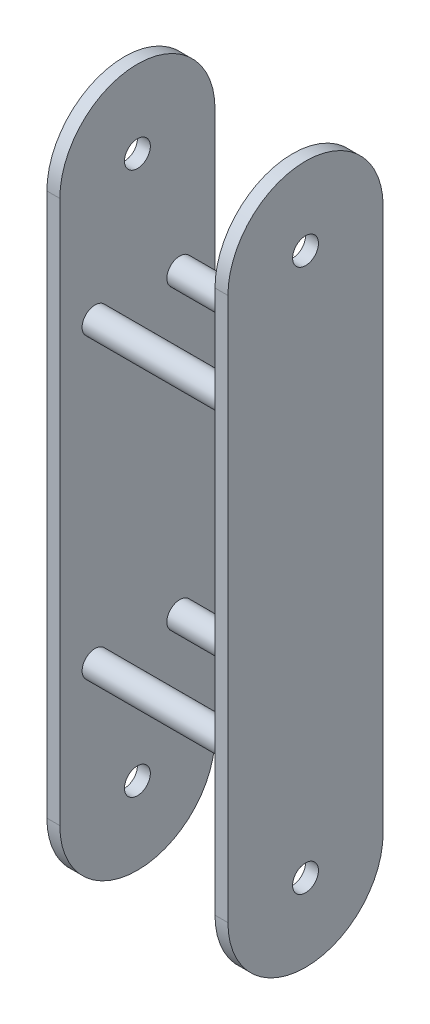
from build123d import *

# Parameters (mm, degrees)
BOSS_EXTRUDE1_DEPTH = 5
BOSS_EXTRUDE2_DEPTH = 5
SKETCH3_R           = 5
CUT_EXTRUDE1_DEPTH  = 156
BOSS_EXTRUDE3_REACH = 157
SKETCH4_R           = 5


with BuildPart() as part:
    # Sketch1 → Boss-Extrude1 (new body)
    with BuildSketch(Plane(origin=(35, 0, 0), x_dir=(0, 0, -1), z_dir=(1, 0, 0))):
        with BuildLine():
            Line((-30, 105), (-30, -105))
            ThreePointArc((-30, -105), (0, -135), (30, -105))
            Line((30, -105), (30, 105))
            ThreePointArc((30, 105), (0, 135), (-30, 105))
        make_face()
    extrude(amount=-BOSS_EXTRUDE1_DEPTH)


with BuildPart() as body_2:
    # Sketch2 → Boss-Extrude2 (new body)
    with BuildSketch(Plane(origin=(-35, 0, 0), x_dir=(0, 0, -1), z_dir=(1, 0, 0))):
        with BuildLine():
            Line((-30, 105), (-30, -105))
            ThreePointArc((-30, -105), (0, -135), (30, -105))
            Line((30, -105), (30, 105))
            ThreePointArc((30, 105), (0, 135), (-30, 105))
        make_face()
    extrude(amount=BOSS_EXTRUDE2_DEPTH)


with BuildPart() as cut_extrude1_tool:
    # Sketch3 → Cut-Extrude1 (new, through all)
    with BuildSketch(Plane(origin=(35, 0, 0), x_dir=(0, 0, -1), z_dir=(1, 0, 0))):
        with Locations((0, 105)):
            Circle(SKETCH3_R)
        with Locations((0, -105)):
            Circle(SKETCH3_R)
    extrude(amount=-CUT_EXTRUDE1_DEPTH)


with BuildPart() as part_1:
    add(part.part)

    # Cut-Extrude1: cut by cut_extrude1_tool
    add(cut_extrude1_tool.part, mode=Mode.SUBTRACT)


with BuildPart() as body_2_1:
    add(body_2.part)

    # Cut-Extrude1: cut by cut_extrude1_tool
    add(cut_extrude1_tool.part, mode=Mode.SUBTRACT)

    # Sketch4 → Boss-Extrude3 (add, up to next)
    with BuildSketch(Plane(origin=(35, 0, 0), x_dir=(0, 0, -1), z_dir=(1, 0, 0)), mode=Mode.PRIVATE) as boss_extrude3_sk1:
        with Locations((-16.384849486, 57.528525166)):
            Circle(SKETCH4_R)
    boss_extrude3_tool1 = extrude(boss_extrude3_sk1.sketch, amount=-BOSS_EXTRUDE3_REACH, mode=Mode.PRIVATE) - body_2_1.part
    # Sketch4 → Boss-Extrude3 (add, up to next)
    with BuildSketch(Plane(origin=(35, 0, 0), x_dir=(0, 0, -1), z_dir=(1, 0, 0)), mode=Mode.PRIVATE) as boss_extrude3_sk2:
        with Locations((16.384849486, 57.528525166)):
            Circle(SKETCH4_R)
    boss_extrude3_tool2 = extrude(boss_extrude3_sk2.sketch, amount=-BOSS_EXTRUDE3_REACH, mode=Mode.PRIVATE) - body_2_1.part
    # Sketch4 → Boss-Extrude3 (add, up to next)
    with BuildSketch(Plane(origin=(35, 0, 0), x_dir=(0, 0, -1), z_dir=(1, 0, 0)), mode=Mode.PRIVATE) as boss_extrude3_sk3:
        with Locations((16.384849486, -57.528525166)):
            Circle(SKETCH4_R)
    boss_extrude3_tool3 = extrude(boss_extrude3_sk3.sketch, amount=-BOSS_EXTRUDE3_REACH, mode=Mode.PRIVATE) - body_2_1.part
    # Sketch4 → Boss-Extrude3 (add, up to next)
    with BuildSketch(Plane(origin=(35, 0, 0), x_dir=(0, 0, -1), z_dir=(1, 0, 0)), mode=Mode.PRIVATE) as boss_extrude3_sk4:
        with Locations((-16.384849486, -57.528525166)):
            Circle(SKETCH4_R)
    boss_extrude3_tool4 = extrude(boss_extrude3_sk4.sketch, amount=-BOSS_EXTRUDE3_REACH, mode=Mode.PRIVATE) - body_2_1.part

    add(part_1.part)  # Boss-Extrude3 merges part
    add(boss_extrude3_tool1.solids().sort_by_distance((35, 57.528525, 16.384849))[0])
    add(boss_extrude3_tool2.solids().sort_by_distance((35, 57.528525, -16.384849))[0])
    add(boss_extrude3_tool3.solids().sort_by_distance((35, -57.528525, -16.384849))[0])
    add(boss_extrude3_tool4.solids().sort_by_distance((35, -57.528525, 16.384849))[0])


solid = body_2_1.part
